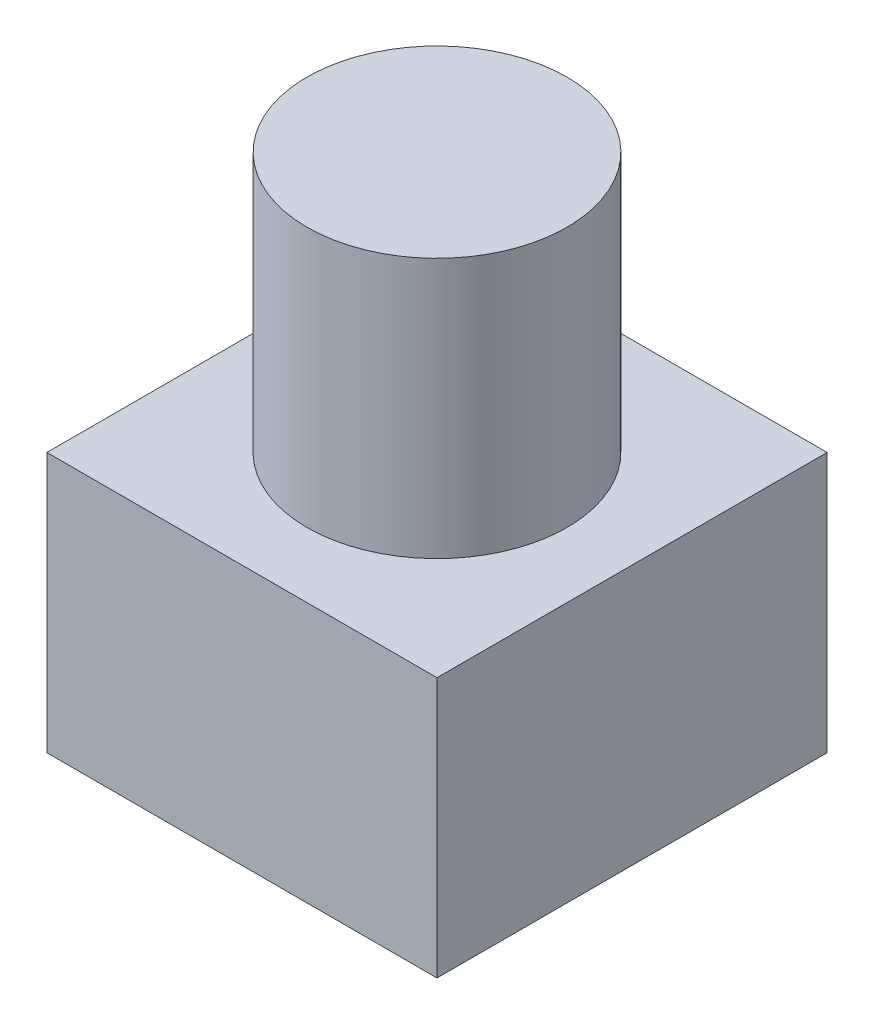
from build123d import *

# Parameters (mm, degrees)
SZKIC2_R                    = 5
DODANIE_WYCI_GNI_CIE1_DEPTH = 20
SZKIC2_3_W                  = 15
SZKIC2_3_H                  = 15
DODANIE_WYCI_GNI_CIE2_DEPTH = 10


with BuildPart() as part:
    # Szkic2 → Dodanie-wyci_gni_cie1 (new body)
    with BuildSketch(Plane(origin=(0, 0, 0), x_dir=(1, 0, 0), z_dir=(0, 1, 0))):
        with Locations(Location((0, 0, 0), (0, 0, 270))):
            Circle(SZKIC2_R)
    extrude(amount=DODANIE_WYCI_GNI_CIE1_DEPTH)

    # Szkic2_3 → Dodanie-wyci_gni_cie2 (add)
    with BuildSketch(Plane(origin=(0, 0, 0), x_dir=(1, 0, 0), z_dir=(0, 1, 0))):
        Rectangle(SZKIC2_3_W, SZKIC2_3_H)
    extrude(amount=DODANIE_WYCI_GNI_CIE2_DEPTH)


solid = part.part
